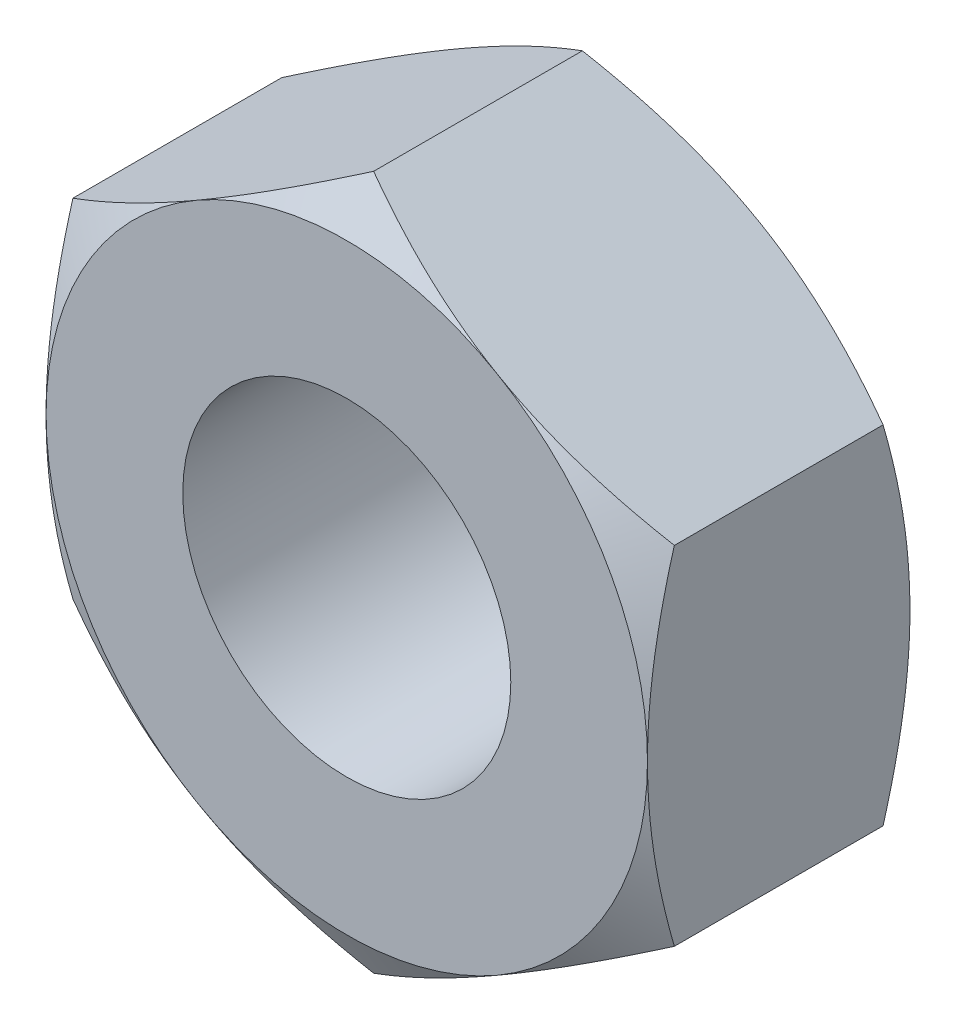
from build123d import *

# Parameters (mm, degrees)
BASE_EXTRUSION_DEPTH    = 2.4
ESQUISSE3_R             = 1.5
ENL_V_MAT_EXTRU_1_DEPTH = 5.837957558


with BuildPart() as part:
    # Esquisse1 → Base-Extrusion (new body)
    with BuildSketch(Plane.XY):
        Polygon((2.75, -1.58771324), (2.75, 1.58771324), (0, 3.175426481), (-2.75, 1.58771324), (-2.75, -1.58771324), (0, -3.175426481), align=None)
    extrude(amount=-BASE_EXTRUSION_DEPTH)

    # Esquisse2 → Enl_vement de mati_re-R_volution1 (revolve, cut)
    with BuildSketch(Plane(origin=(0, 0, 0), x_dir=(1, 0, 0), z_dir=(0, 1, 0)), mode=Mode.PRIVATE) as enl_vement_de_mati_re_r_volution1_sk:
        Polygon((-2.75, 0), (-5.828460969, 0), (-5.828460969, 2.4), (-2.75, 2.4), (-4.828460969, 1.2), align=None)
    revolve(enl_vement_de_mati_re_r_volution1_sk.sketch.rotate(Axis((0, 0, -2.4), (0, 0, 1)), 180), axis=Axis((0, 0, -2.4), (0, 0, 1)), mode=Mode.SUBTRACT)

    # Esquisse3 → Enl_v. mat.-Extru.1 (cut, through all)
    with BuildSketch(Plane.XY):
        Circle(ESQUISSE3_R)
    extrude(amount=-ENL_V_MAT_EXTRU_1_DEPTH, mode=Mode.SUBTRACT)


solid = part.part
